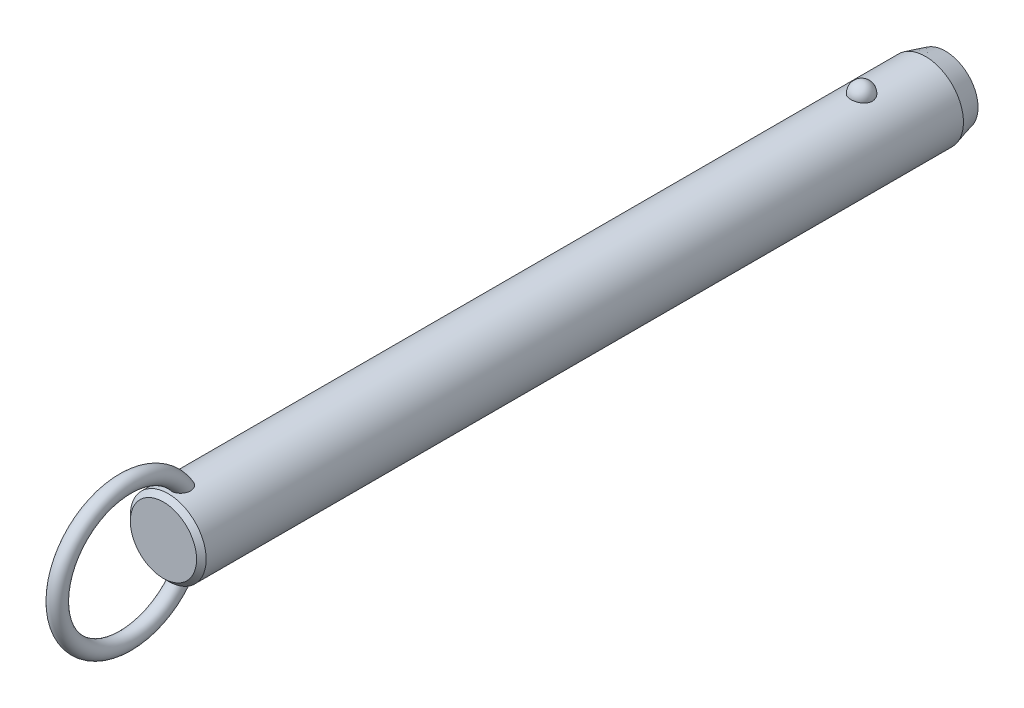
ISO-10303-21;
HEADER;
FILE_DESCRIPTION(('STEP AP214'),'2;1');
FILE_NAME('part.step','',(''),(''),'','','');
FILE_SCHEMA(('AUTOMOTIVE_DESIGN { 1 0 10303 214 1 1 1 1 }'));
ENDSEC;
DATA;
#1=APPLICATION_CONTEXT('core data for automotive mechanical design processes');
#2=APPLICATION_PROTOCOL_DEFINITION('international standard','automotive_design',2000,#1);
#3=PRODUCT_CONTEXT('',#1,'mechanical');
#4=PRODUCT('Part','Part','',(#3));
#5=PRODUCT_RELATED_PRODUCT_CATEGORY('part','',(#4));
#6=PRODUCT_DEFINITION_FORMATION('','',#4);
#7=PRODUCT_DEFINITION_CONTEXT('part definition',#1,'design');
#8=PRODUCT_DEFINITION('design','',#6,#7);
#9=PRODUCT_DEFINITION_SHAPE('','',#8);
#10=(LENGTH_UNIT() NAMED_UNIT(*) SI_UNIT(.MILLI.,.METRE.));
#11=(NAMED_UNIT(*) PLANE_ANGLE_UNIT() SI_UNIT($,.RADIAN.));
#12=(NAMED_UNIT(*) SI_UNIT($,.STERADIAN.) SOLID_ANGLE_UNIT());
#13=UNCERTAINTY_MEASURE_WITH_UNIT(LENGTH_MEASURE(1.E-05),#10,'distance_accuracy_value','');
#14=(GEOMETRIC_REPRESENTATION_CONTEXT(3) GLOBAL_UNCERTAINTY_ASSIGNED_CONTEXT((#13)) GLOBAL_UNIT_ASSIGNED_CONTEXT((#10,
#11,#12)) REPRESENTATION_CONTEXT('',''));
#15=CARTESIAN_POINT('',(0.,0.,0.));
#16=DIRECTION('',(0.,0.,1.));
#17=DIRECTION('',(1.,0.,0.));
#18=AXIS2_PLACEMENT_3D('',#15,#16,#17);
#19=CARTESIAN_POINT('',(0.,0.,162.6));
#20=DIRECTION('',(0.,0.,-1.));
#21=DIRECTION('',(-1.,0.,0.));
#22=AXIS2_PLACEMENT_3D('',#19,#20,#21);
#23=CYLINDRICAL_SURFACE('',#22,9.5);
#24=CARTESIAN_POINT('',(2.67259918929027,9.11631578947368,-2.70000000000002));
#25=CARTESIAN_POINT('',(2.6725968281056,9.11631786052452,-2.54909854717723));
#26=CARTESIAN_POINT('',(2.66030567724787,9.11994722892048,-2.39816735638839));
#27=CARTESIAN_POINT('',(2.6114347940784,9.13405924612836,-2.10058568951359));
#28=CARTESIAN_POINT('',(2.57484658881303,9.14454428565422,-1.95393672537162));
#29=CARTESIAN_POINT('',(2.47830875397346,9.17117631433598,-1.66916069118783));
#30=CARTESIAN_POINT('',(2.41836936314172,9.18732082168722,-1.53102991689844));
#31=CARTESIAN_POINT('',(2.27661331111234,9.22346780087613,-1.26705393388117));
#32=CARTESIAN_POINT('',(2.19479699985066,9.24347021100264,-1.14120852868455));
#33=CARTESIAN_POINT('',(2.01085282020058,9.28522401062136,-0.904632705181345));
#34=CARTESIAN_POINT('',(1.90862396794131,9.30698376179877,-0.793982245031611));
#35=CARTESIAN_POINT('',(1.6867437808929,9.34973971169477,-0.59160721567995));
#36=CARTESIAN_POINT('',(1.56709244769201,9.37073591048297,-0.499882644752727));
#37=CARTESIAN_POINT('',(1.31393976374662,9.40956370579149,-0.338167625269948));
#38=CARTESIAN_POINT('',(1.18048026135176,9.42740444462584,-0.268113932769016));
#39=CARTESIAN_POINT('',(0.903154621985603,9.45799906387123,-0.151390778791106));
#40=CARTESIAN_POINT('',(0.759289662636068,9.47075351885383,-0.104718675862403));
#41=CARTESIAN_POINT('',(0.468074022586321,9.48956256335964,-0.0367633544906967));
#42=CARTESIAN_POINT('',(0.320836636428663,9.49573643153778,-0.0150275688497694));
#43=CARTESIAN_POINT('',(0.0246714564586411,9.50112183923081,0.00396199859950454));
#44=CARTESIAN_POINT('',(-0.124256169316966,9.50033406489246,0.00121819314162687));
#45=CARTESIAN_POINT('',(-0.417264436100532,9.4919475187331,-0.0284441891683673));
#46=CARTESIAN_POINT('',(-0.56138413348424,9.48444885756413,-0.0550074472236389));
#47=CARTESIAN_POINT('',(-0.842986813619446,9.46357853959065,-0.131064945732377));
#48=CARTESIAN_POINT('',(-0.980469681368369,9.450206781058,-0.180559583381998));
#49=CARTESIAN_POINT('',(-1.24585005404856,9.41890822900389,-0.301476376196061));
#50=CARTESIAN_POINT('',(-1.37368611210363,9.40095498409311,-0.373026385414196));
#51=CARTESIAN_POINT('',(-1.61552738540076,9.36242964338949,-0.536025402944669));
#52=CARTESIAN_POINT('',(-1.72953116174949,9.34185727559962,-0.627476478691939));
#53=CARTESIAN_POINT('',(-1.9429225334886,9.29984568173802,-0.829844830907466));
#54=CARTESIAN_POINT('',(-2.04198021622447,9.27839736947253,-0.941108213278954));
#55=CARTESIAN_POINT('',(-2.22026460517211,9.23735994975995,-1.17883414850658));
#56=CARTESIAN_POINT('',(-2.29948985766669,9.21777097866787,-1.30529781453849));
#57=CARTESIAN_POINT('',(-2.43697287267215,9.18238994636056,-1.57158566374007));
#58=CARTESIAN_POINT('',(-2.49497068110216,9.16664569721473,-1.71155057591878));
#59=CARTESIAN_POINT('',(-2.5872073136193,9.14104303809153,-1.99961197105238));
#60=CARTESIAN_POINT('',(-2.62144683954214,9.13118445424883,-2.1477082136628));
#61=CARTESIAN_POINT('',(-2.66521466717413,9.11850622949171,-2.44715424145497));
#62=CARTESIAN_POINT('',(-2.67484831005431,9.11565658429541,-2.59848735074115));
#63=CARTESIAN_POINT('',(-2.66946735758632,9.11723375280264,-2.90067317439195));
#64=CARTESIAN_POINT('',(-2.65445345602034,9.12166036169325,-3.05152590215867));
#65=CARTESIAN_POINT('',(-2.60029711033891,9.13724422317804,-3.34766110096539));
#66=CARTESIAN_POINT('',(-2.56127978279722,9.14836656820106,-3.49296833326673));
#67=CARTESIAN_POINT('',(-2.46018844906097,9.17606676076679,-3.77477535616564));
#68=CARTESIAN_POINT('',(-2.39811349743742,9.1926448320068,-3.91127478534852));
#69=CARTESIAN_POINT('',(-2.25202303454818,9.22952198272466,-4.17244273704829));
#70=CARTESIAN_POINT('',(-2.16788714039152,9.24984129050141,-4.29704106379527));
#71=CARTESIAN_POINT('',(-1.9799408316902,9.29188255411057,-4.53013066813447));
#72=CARTESIAN_POINT('',(-1.87612963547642,9.31360456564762,-4.63862130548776));
#73=CARTESIAN_POINT('',(-1.65105429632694,9.35612959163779,-4.83690299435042));
#74=CARTESIAN_POINT('',(-1.52972405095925,9.37692871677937,-4.9266199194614));
#75=CARTESIAN_POINT('',(-1.27318250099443,9.41518970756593,-5.08429106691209));
#76=CARTESIAN_POINT('',(-1.13797219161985,9.432651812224,-5.15224684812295));
#77=CARTESIAN_POINT('',(-0.859280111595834,9.46208255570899,-5.26371827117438));
#78=CARTESIAN_POINT('',(-0.715925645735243,9.47411833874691,-5.30753421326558));
#79=CARTESIAN_POINT('',(-0.423550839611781,9.4916822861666,-5.37076321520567));
#80=CARTESIAN_POINT('',(-0.2745312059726,9.49721125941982,-5.39017930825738));
#81=CARTESIAN_POINT('',(0.0218446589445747,9.50110860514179,-5.40390587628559));
#82=CARTESIAN_POINT('',(0.16917707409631,9.49961381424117,-5.39869609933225));
#83=CARTESIAN_POINT('',(0.460808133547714,9.48993906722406,-5.36441955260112));
#84=CARTESIAN_POINT('',(0.605106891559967,9.48175936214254,-5.33535367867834));
#85=CARTESIAN_POINT('',(0.886027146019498,9.4596376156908,-5.25435587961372));
#86=CARTESIAN_POINT('',(1.02267710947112,9.44571881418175,-5.20251612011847));
#87=CARTESIAN_POINT('',(1.28523827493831,9.41358993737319,-5.07741549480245));
#88=CARTESIAN_POINT('',(1.41114877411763,9.39537958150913,-5.00415322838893));
#89=CARTESIAN_POINT('',(1.65085227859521,9.3562644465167,-4.83684599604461));
#90=CARTESIAN_POINT('',(1.76442346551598,9.33532178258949,-4.74249218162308));
#91=CARTESIAN_POINT('',(1.97425672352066,9.29321198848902,-4.53620389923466));
#92=CARTESIAN_POINT('',(2.07051582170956,9.27204482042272,-4.42426641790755));
#93=CARTESIAN_POINT('',(2.24490086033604,9.23139221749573,-4.18363183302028));
#94=CARTESIAN_POINT('',(2.32267019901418,9.21194380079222,-4.05466990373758));
#95=CARTESIAN_POINT('',(2.45584092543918,9.1773419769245,-3.78517836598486));
#96=CARTESIAN_POINT('',(2.5112497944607,9.16218713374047,-3.644652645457));
#97=CARTESIAN_POINT('',(2.59380876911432,9.13913522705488,-3.37104301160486));
#98=CARTESIAN_POINT('',(2.62330266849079,9.13064624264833,-3.23871053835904));
#99=CARTESIAN_POINT('',(2.66269870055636,9.11923566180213,-2.97092664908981));
#100=CARTESIAN_POINT('',(2.67260130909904,9.11631393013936,-2.83547530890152));
#101=CARTESIAN_POINT('',(2.67259918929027,9.11631578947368,-2.70000000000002));
#102=B_SPLINE_CURVE_WITH_KNOTS('',3,(#24,#25,#26,#27,#28,#29,#30,#31,#32,#33,#34,#35,#36,#37,
#38,#39,#40,#41,#42,#43,#44,#45,#46,#47,#48,#49,#50,#51,#52,#53,#54,#55,#56,#57,#58,#59,#60,#61,
#62,#63,#64,#65,#66,#67,#68,#69,#70,#71,#72,#73,#74,#75,#76,#77,#78,#79,#80,#81,#82,#83,#84,#85,
#86,#87,#88,#89,#90,#91,#92,#93,#94,#95,#96,#97,#98,#99,#100,#101),.UNSPECIFIED.,.T.,.F.,(4,2,2,
2,2,2,2,2,2,2,2,2,2,2,2,2,2,2,2,2,2,2,2,2,2,2,2,2,2,2,2,2,2,2,2,2,2,2,4),(0.,0.452217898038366,
0.904593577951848,1.35677112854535,1.80894144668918,2.26340676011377,2.71787203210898,
3.17099820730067,3.62407318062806,4.0687883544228,4.51345969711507,4.95160616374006,
5.38976021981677,5.83050358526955,6.27129275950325,6.72071308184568,7.17016633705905,
7.62495278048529,8.07972578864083,8.53254856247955,8.98535859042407,9.43582813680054,
9.88631615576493,10.3393155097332,10.7923328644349,11.2471065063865,11.7018475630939,
12.150795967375,12.599688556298,13.0398725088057,13.4800399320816,13.9184421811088,
14.3568730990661,14.802202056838,15.2476074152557,15.7010097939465,16.1542603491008,
16.5602594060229,16.966248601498),.UNSPECIFIED.);
#103=CARTESIAN_POINT('',(2.67259918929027,9.11631578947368,-2.70000000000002));
#104=VERTEX_POINT('',#103);
#105=EDGE_CURVE('E41',#104,#104,#102,.T.);
#106=ORIENTED_EDGE('',*,*,#105,.T.);
#107=EDGE_LOOP('',(#106));
#108=FACE_BOUND('',#107,.T.);
#109=CARTESIAN_POINT('',(0.,0.,170.92));
#110=DIRECTION('',(0.,0.,1.));
#111=DIRECTION('',(1.,0.,0.));
#112=AXIS2_PLACEMENT_3D('',#109,#110,#111);
#113=CIRCLE('',#112,9.5);
#114=CARTESIAN_POINT('',(9.5,0.,170.92));
#115=VERTEX_POINT('',#114);
#116=EDGE_CURVE('E10',#115,#115,#113,.F.);
#117=ORIENTED_EDGE('',*,*,#116,.T.);
#118=EDGE_LOOP('',(#117));
#119=FACE_BOUND('',#118,.T.);
#120=CARTESIAN_POINT('',(-0.697062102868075,-9.47439269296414,165.267808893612));
#121=CARTESIAN_POINT('',(-0.799579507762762,-9.46685146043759,165.307482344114));
#122=CARTESIAN_POINT('',(-0.89857563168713,-9.45788043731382,165.3559309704));
#123=CARTESIAN_POINT('',(-1.08670047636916,-9.43811593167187,165.468868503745));
#124=CARTESIAN_POINT('',(-1.17583204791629,-9.42732297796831,165.533352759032));
#125=CARTESIAN_POINT('',(-1.34179806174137,-9.40513672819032,165.676209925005));
#126=CARTESIAN_POINT('',(-1.41865133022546,-9.39374438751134,165.754561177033));
#127=CARTESIAN_POINT('',(-1.5586004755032,-9.37154196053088,165.922752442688));
#128=CARTESIAN_POINT('',(-1.62169476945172,-9.3607319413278,166.01259377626));
#129=CARTESIAN_POINT('',(-1.73527695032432,-9.34035749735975,166.204500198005));
#130=CARTESIAN_POINT('',(-1.7852226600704,-9.33085270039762,166.306891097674));
#131=CARTESIAN_POINT('',(-1.86924997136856,-9.3143834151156,166.518148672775));
#132=CARTESIAN_POINT('',(-1.90332570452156,-9.30741986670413,166.627017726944));
#133=CARTESIAN_POINT('',(-1.95893603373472,-9.29588482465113,166.860473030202));
#134=CARTESIAN_POINT('',(-1.97872420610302,-9.29165182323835,166.985489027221));
#135=CARTESIAN_POINT('',(-2.00062129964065,-9.28695978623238,167.237080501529));
#136=CARTESIAN_POINT('',(-2.00272284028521,-9.28650232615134,167.363656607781));
#137=CARTESIAN_POINT('',(-1.98958876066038,-9.28932750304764,167.636815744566));
#138=CARTESIAN_POINT('',(-1.97143366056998,-9.2932400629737,167.783251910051));
#139=CARTESIAN_POINT('',(-1.91479925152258,-9.30507151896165,168.072062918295));
#140=CARTESIAN_POINT('',(-1.87629122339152,-9.31299607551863,168.214431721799));
#141=CARTESIAN_POINT('',(-1.7722568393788,-9.33340232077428,168.515172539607));
#142=CARTESIAN_POINT('',(-1.70334898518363,-9.34641636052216,168.672369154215));
#143=CARTESIAN_POINT('',(-1.58111062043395,-9.36759153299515,168.897517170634));
#144=CARTESIAN_POINT('',(-1.53721459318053,-9.3749261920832,168.970796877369));
#145=CARTESIAN_POINT('',(-1.44302631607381,-9.38988566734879,169.11307405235));
#146=CARTESIAN_POINT('',(-1.39273721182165,-9.39751033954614,169.182073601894));
#147=CARTESIAN_POINT('',(-1.26775962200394,-9.41530678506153,169.336983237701));
#148=CARTESIAN_POINT('',(-1.19052326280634,-9.42548108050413,169.420871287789));
#149=CARTESIAN_POINT('',(-1.0242024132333,-9.44499825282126,169.576008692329));
#150=CARTESIAN_POINT('',(-0.935139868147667,-9.45434261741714,169.647280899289));
#151=CARTESIAN_POINT('',(-0.766610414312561,-9.46930670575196,169.758695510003));
#152=CARTESIAN_POINT('',(-0.689439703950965,-9.47529223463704,169.802235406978));
#153=CARTESIAN_POINT('',(-0.52894200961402,-9.48560294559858,169.87631336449));
#154=CARTESIAN_POINT('',(-0.445620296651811,-9.48992953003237,169.906862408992));
#155=CARTESIAN_POINT('',(-0.273901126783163,-9.49644161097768,169.952579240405));
#156=CARTESIAN_POINT('',(-0.18546574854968,-9.49860811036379,169.96761059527));
#157=CARTESIAN_POINT('',(-0.00734541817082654,-9.5004135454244,169.980149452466));
#158=CARTESIAN_POINT('',(0.082338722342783,-9.50005405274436,169.977667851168));
#159=CARTESIAN_POINT('',(0.247679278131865,-9.49708301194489,169.956995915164));
#160=CARTESIAN_POINT('',(0.323620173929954,-9.49477609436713,169.940930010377));
#161=CARTESIAN_POINT('',(0.471981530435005,-9.48855917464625,169.897172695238));
#162=CARTESIAN_POINT('',(0.544400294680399,-9.48464840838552,169.869475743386));
#163=CARTESIAN_POINT('',(0.708947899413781,-9.47398336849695,169.79280266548));
#164=CARTESIAN_POINT('',(0.799149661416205,-9.46671310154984,169.739774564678));
#165=CARTESIAN_POINT('',(0.969783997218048,-9.45076225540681,169.619973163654));
#166=CARTESIAN_POINT('',(1.05019415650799,-9.44207854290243,169.553169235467));
#167=CARTESIAN_POINT('',(1.23092343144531,-9.42051459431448,169.380759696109));
#168=CARTESIAN_POINT('',(1.32652499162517,-9.40733378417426,169.27026193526));
#169=CARTESIAN_POINT('',(1.49893121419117,-9.38140745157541,169.035561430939));
#170=CARTESIAN_POINT('',(1.57571616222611,-9.36866239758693,168.911344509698));
#171=CARTESIAN_POINT('',(1.71285426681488,-9.34457644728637,168.649389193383));
#172=CARTESIAN_POINT('',(1.77266365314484,-9.33328726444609,168.51136233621));
#173=CARTESIAN_POINT('',(1.87239208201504,-9.31379209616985,168.228051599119));
#174=CARTESIAN_POINT('',(1.91230158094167,-9.30558759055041,168.082764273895));
#175=CARTESIAN_POINT('',(1.97604189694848,-9.29228394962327,167.762028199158));
#176=CARTESIAN_POINT('',(1.9958743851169,-9.28797202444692,167.585724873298));
#177=CARTESIAN_POINT('',(2.00295708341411,-9.28645519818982,167.232414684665));
#178=CARTESIAN_POINT('',(1.99025930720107,-9.28923895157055,167.055409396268));
#179=CARTESIAN_POINT('',(1.93735479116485,-9.30038134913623,166.756338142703));
#180=CARTESIAN_POINT('',(1.90576827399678,-9.30697680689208,166.632667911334));
#181=CARTESIAN_POINT('',(1.82287484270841,-9.32356855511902,166.392329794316));
#182=CARTESIAN_POINT('',(1.77158213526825,-9.33356239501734,166.275656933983));
#183=CARTESIAN_POINT('',(1.64885744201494,-9.35602275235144,166.052706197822));
#184=CARTESIAN_POINT('',(1.57730995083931,-9.36850332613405,165.946492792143));
#185=CARTESIAN_POINT('',(1.41543264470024,-9.39431873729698,165.749553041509));
#186=CARTESIAN_POINT('',(1.32510883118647,-9.40765330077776,165.658821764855));
#187=CARTESIAN_POINT('',(1.13846223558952,-9.43195720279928,165.505033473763));
#188=CARTESIAN_POINT('',(1.04369890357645,-9.44302894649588,165.440094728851));
#189=CARTESIAN_POINT('',(0.843965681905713,-9.46296805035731,165.328038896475));
#190=CARTESIAN_POINT('',(0.739000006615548,-9.47183631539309,165.280914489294));
#191=CARTESIAN_POINT('',(0.528175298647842,-9.48586140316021,165.208117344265));
#192=CARTESIAN_POINT('',(0.422686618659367,-9.49119633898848,165.18140249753));
#193=CARTESIAN_POINT('',(0.208590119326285,-9.49831365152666,165.146013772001));
#194=CARTESIAN_POINT('',(0.0999817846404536,-9.500095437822,165.137342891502));
#195=CARTESIAN_POINT('',(-0.126104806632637,-9.49988861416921,165.138350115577));
#196=CARTESIAN_POINT('',(-0.24357872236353,-9.49757821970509,165.149594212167));
#197=CARTESIAN_POINT('',(-0.474390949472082,-9.48885165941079,165.193167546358));
#198=CARTESIAN_POINT('',(-0.587729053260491,-9.48243528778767,165.225497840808));
#199=CARTESIAN_POINT('',(-0.697062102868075,-9.47439269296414,165.267808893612));
#200=B_SPLINE_CURVE_WITH_KNOTS('',3,(#120,#121,#122,#123,#124,#125,#126,#127,#128,#129,#130,
#131,#132,#133,#134,#135,#136,#137,#138,#139,#140,#141,#142,#143,#144,#145,#146,#147,#148,#149,
#150,#151,#152,#153,#154,#155,#156,#157,#158,#159,#160,#161,#162,#163,#164,#165,#166,#167,#168,
#169,#170,#171,#172,#173,#174,#175,#176,#177,#178,#179,#180,#181,#182,#183,#184,#185,#186,#187,
#188,#189,#190,#191,#192,#193,#194,#195,#196,#197,#198,#199),.UNSPECIFIED.,.T.,.F.,(4,2,2,2,2,2,
2,2,2,2,2,2,2,2,2,2,2,2,2,2,2,2,2,2,2,2,2,2,2,2,2,2,2,2,2,2,2,2,2,4),(0.,0.330119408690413,
0.6601431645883,0.98965593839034,1.31920659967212,1.66074728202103,2.00241415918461,
2.38088696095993,2.75951768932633,3.20065679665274,3.64242004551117,4.15620996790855,
4.4131416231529,4.66994734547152,5.01228664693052,5.35399933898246,5.61943037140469,
5.88463652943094,6.15215502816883,6.41950709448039,6.65144391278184,6.88349136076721,
7.19641200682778,7.51003602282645,7.94779711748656,8.3860149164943,8.83699707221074,
9.28819530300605,9.81778662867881,10.34653170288,10.7284172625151,11.1100280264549,
11.4938603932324,11.8775702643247,12.2220189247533,12.5663259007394,12.8915939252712,
13.2169159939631,13.5689650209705,13.9210316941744),.UNSPECIFIED.);
#201=CARTESIAN_POINT('',(-0.697062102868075,-9.47439269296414,165.267808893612));
#202=VERTEX_POINT('',#201);
#203=EDGE_CURVE('E60',#202,#202,#200,.T.);
#204=ORIENTED_EDGE('',*,*,#203,.T.);
#205=EDGE_LOOP('',(#204));
#206=FACE_BOUND('',#205,.T.);
#207=CARTESIAN_POINT('',(-0.697062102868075,9.47439269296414,165.267808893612));
#208=CARTESIAN_POINT('',(-0.597792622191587,9.48169483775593,165.22939564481));
#209=CARTESIAN_POINT('',(-0.495106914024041,9.48766580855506,165.199168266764));
#210=CARTESIAN_POINT('',(-0.285876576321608,9.49627648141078,165.156032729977));
#211=CARTESIAN_POINT('',(-0.179324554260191,9.49890941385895,165.143159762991));
#212=CARTESIAN_POINT('',(0.0344157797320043,9.50053798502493,165.135166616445));
#213=CARTESIAN_POINT('',(0.14160360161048,9.49953613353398,165.140034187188));
#214=CARTESIAN_POINT('',(0.353563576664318,9.49401038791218,165.167365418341));
#215=CARTESIAN_POINT('',(0.458336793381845,9.48948807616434,165.18982117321));
#216=CARTESIAN_POINT('',(0.662493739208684,9.4774236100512,165.251671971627));
#217=CARTESIAN_POINT('',(0.761881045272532,9.46988348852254,165.291055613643));
#218=CARTESIAN_POINT('',(0.952608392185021,9.45260382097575,165.385634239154));
#219=CARTESIAN_POINT('',(1.04394806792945,9.44286417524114,165.440829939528));
#220=CARTESIAN_POINT('',(1.21712767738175,9.42211760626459,165.566066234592));
#221=CARTESIAN_POINT('',(1.29885671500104,9.41109835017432,165.636257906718));
#222=CARTESIAN_POINT('',(1.44978975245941,9.38903310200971,165.788980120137));
#223=CARTESIAN_POINT('',(1.51899278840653,9.37798710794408,165.871511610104));
#224=CARTESIAN_POINT('',(1.64602857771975,9.35654375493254,166.049776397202));
#225=CARTESIAN_POINT('',(1.70333052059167,9.34618688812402,166.145891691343));
#226=CARTESIAN_POINT('',(1.80259341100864,9.32755128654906,166.345897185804));
#227=CARTESIAN_POINT('',(1.84454942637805,9.31927322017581,166.449789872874));
#228=CARTESIAN_POINT('',(1.91637039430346,9.30478365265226,166.672213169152));
#229=CARTESIAN_POINT('',(1.944805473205,9.29882552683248,166.791219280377));
#230=CARTESIAN_POINT('',(1.98449865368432,9.29043398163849,167.032143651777));
#231=CARTESIAN_POINT('',(1.99574908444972,9.28800213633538,167.154063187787));
#232=CARTESIAN_POINT('',(2.00275141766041,9.28649645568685,167.416932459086));
#233=CARTESIAN_POINT('',(1.99588238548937,9.28799035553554,167.557952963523));
#234=CARTESIAN_POINT('',(1.96270559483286,9.29505517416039,167.837621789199));
#235=CARTESIAN_POINT('',(1.93637872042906,9.30063010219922,167.976267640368));
#236=CARTESIAN_POINT('',(1.85949176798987,9.31633564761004,168.272561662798));
#237=CARTESIAN_POINT('',(1.80549792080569,9.3270926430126,168.429290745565));
#238=CARTESIAN_POINT('',(1.67376869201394,9.3516306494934,168.732284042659));
#239=CARTESIAN_POINT('',(1.59603181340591,9.36541185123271,168.878547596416));
#240=CARTESIAN_POINT('',(1.4360277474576,9.39110706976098,169.125813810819));
#241=CARTESIAN_POINT('',(1.35831795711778,9.40278656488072,169.229791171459));
#242=CARTESIAN_POINT('',(1.18774483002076,9.42585025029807,169.424534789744));
#243=CARTESIAN_POINT('',(1.09490932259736,9.43723493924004,169.515324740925));
#244=CARTESIAN_POINT('',(0.921110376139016,9.45552616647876,169.65620334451));
#245=CARTESIAN_POINT('',(0.843738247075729,9.46281058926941,169.710656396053));
#246=CARTESIAN_POINT('',(0.681245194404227,9.47589120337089,169.806711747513));
#247=CARTESIAN_POINT('',(0.596135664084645,9.48168953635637,169.848332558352));
#248=CARTESIAN_POINT('',(0.433779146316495,9.49038144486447,169.910089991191));
#249=CARTESIAN_POINT('',(0.35745955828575,9.49359170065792,169.93260136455));
#250=CARTESIAN_POINT('',(0.202074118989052,9.49816761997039,169.964574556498));
#251=CARTESIAN_POINT('',(0.123010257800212,9.49953459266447,169.974045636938));
#252=CARTESIAN_POINT('',(-0.0357372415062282,9.50026497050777,169.979114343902));
#253=CARTESIAN_POINT('',(-0.115421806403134,9.49962433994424,169.974684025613));
#254=CARTESIAN_POINT('',(-0.272823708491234,9.49640854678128,169.952296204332));
#255=CARTESIAN_POINT('',(-0.350540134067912,9.4938325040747,169.934332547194));
#256=CARTESIAN_POINT('',(-0.500580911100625,9.48709462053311,169.886802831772));
#257=CARTESIAN_POINT('',(-0.572979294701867,9.48296359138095,169.857461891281));
#258=CARTESIAN_POINT('',(-0.71286452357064,9.47347609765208,169.789008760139));
#259=CARTESIAN_POINT('',(-0.780349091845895,9.46811906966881,169.749892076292));
#260=CARTESIAN_POINT('',(-0.946309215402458,9.45329720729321,169.639432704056));
#261=CARTESIAN_POINT('',(-1.04090230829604,9.44321512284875,169.562329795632));
#262=CARTESIAN_POINT('',(-1.21661929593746,9.42219227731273,169.39409718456));
#263=CARTESIAN_POINT('',(-1.29770519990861,9.41124921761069,169.302929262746));
#264=CARTESIAN_POINT('',(-1.47319646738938,9.38563439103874,169.076162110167));
#265=CARTESIAN_POINT('',(-1.5620887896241,9.37102009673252,168.936289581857));
#266=CARTESIAN_POINT('',(-1.71623987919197,9.34401559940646,168.643950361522));
#267=CARTESIAN_POINT('',(-1.7814786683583,9.33162728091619,168.491473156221));
#268=CARTESIAN_POINT('',(-1.88853837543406,9.31055541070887,168.175647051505));
#269=CARTESIAN_POINT('',(-1.92998995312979,9.30193076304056,168.012168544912));
#270=CARTESIAN_POINT('',(-1.98590726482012,9.29015757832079,167.680526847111));
#271=CARTESIAN_POINT('',(-2.0004070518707,9.2870021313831,167.512369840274));
#272=CARTESIAN_POINT('',(-1.99964701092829,9.28716218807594,167.205080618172));
#273=CARTESIAN_POINT('',(-1.98908145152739,9.28945704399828,167.065936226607));
#274=CARTESIAN_POINT('',(-1.94566294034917,9.29865169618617,166.791153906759));
#275=CARTESIAN_POINT('',(-1.91282062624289,9.30554929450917,166.655514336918));
#276=CARTESIAN_POINT('',(-1.84582133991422,9.31898248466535,166.457802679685));
#277=CARTESIAN_POINT('',(-1.82038084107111,9.32400364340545,166.392583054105));
#278=CARTESIAN_POINT('',(-1.7635051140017,9.33492884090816,166.264903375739));
#279=CARTESIAN_POINT('',(-1.73207305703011,9.34083241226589,166.202441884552));
#280=CARTESIAN_POINT('',(-1.66324243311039,9.35333332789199,166.08094078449));
#281=CARTESIAN_POINT('',(-1.625842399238,9.35993084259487,166.021902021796));
#282=CARTESIAN_POINT('',(-1.54527678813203,9.37356864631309,165.907987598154));
#283=CARTESIAN_POINT('',(-1.50211241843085,9.38060884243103,165.853111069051));
#284=CARTESIAN_POINT('',(-1.37681147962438,9.40004442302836,165.709961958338));
#285=CARTESIAN_POINT('',(-1.28916358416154,9.41261047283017,165.626429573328));
#286=CARTESIAN_POINT('',(-1.09996826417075,9.43658180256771,165.477236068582));
#287=CARTESIAN_POINT('',(-0.998461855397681,9.44799034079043,165.411523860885));
#288=CARTESIAN_POINT('',(-0.860188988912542,9.46103017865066,165.3394367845));
#289=CARTESIAN_POINT('',(-0.828141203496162,9.46389141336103,165.323851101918));
#290=CARTESIAN_POINT('',(-0.763210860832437,9.46934915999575,165.294473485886));
#291=CARTESIAN_POINT('',(-0.730328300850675,9.47194567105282,165.280681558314));
#292=CARTESIAN_POINT('',(-0.697062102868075,9.47439269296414,165.267808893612));
#293=B_SPLINE_CURVE_WITH_KNOTS('',3,(#207,#208,#209,#210,#211,#212,#213,#214,#215,#216,#217,
#218,#219,#220,#221,#222,#223,#224,#225,#226,#227,#228,#229,#230,#231,#232,#233,#234,#235,#236,
#237,#238,#239,#240,#241,#242,#243,#244,#245,#246,#247,#248,#249,#250,#251,#252,#253,#254,#255,
#256,#257,#258,#259,#260,#261,#262,#263,#264,#265,#266,#267,#268,#269,#270,#271,#272,#273,#274,
#275,#276,#277,#278,#279,#280,#281,#282,#283,#284,#285,#286,#287,#288,#289,#290,#291,#292),
.UNSPECIFIED.,.T.,.F.,(4,2,2,2,2,2,2,2,2,2,2,2,2,2,2,2,2,2,2,2,2,2,2,2,2,2,2,2,2,2,2,2,2,2,2,2,
2,2,2,2,2,2,4),(0.,0.319942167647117,0.640532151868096,0.960900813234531,1.28112555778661,
1.60113495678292,1.92115886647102,2.24457323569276,2.56801248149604,2.90371927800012,
3.23953387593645,3.60560313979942,3.97183576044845,4.39383693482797,4.81625324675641,
5.31257045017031,5.80891895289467,6.19868344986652,6.58773876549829,6.87145417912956,
7.15475838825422,7.3926375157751,7.63034760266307,7.86853584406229,8.10683246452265,
8.3406366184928,8.57454843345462,8.93983939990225,9.30614105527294,9.80266668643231,
10.2996107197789,10.8040753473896,11.3079021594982,11.7249776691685,12.1418541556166,
12.3521485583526,12.5623319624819,12.7725671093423,12.9827582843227,13.345827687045,
13.7078449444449,13.8150604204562,13.9222762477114),.UNSPECIFIED.);
#294=CARTESIAN_POINT('',(-0.697062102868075,9.47439269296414,165.267808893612));
#295=VERTEX_POINT('',#294);
#296=EDGE_CURVE('E68',#295,#295,#293,.T.);
#297=ORIENTED_EDGE('',*,*,#296,.T.);
#298=EDGE_LOOP('',(#297));
#299=FACE_BOUND('',#298,.T.);
#300=CARTESIAN_POINT('',(0.,0.,-18.6999999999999));
#301=DIRECTION('',(0.,0.,-1.));
#302=DIRECTION('',(-1.,0.,0.));
#303=AXIS2_PLACEMENT_3D('',#300,#301,#302);
#304=CIRCLE('',#303,9.5);
#305=CARTESIAN_POINT('',(-9.5,0.,-18.6999999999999));
#306=VERTEX_POINT('',#305);
#307=EDGE_CURVE('E57',#306,#306,#304,.F.);
#308=ORIENTED_EDGE('',*,*,#307,.T.);
#309=EDGE_LOOP('',(#308));
#310=FACE_BOUND('',#309,.T.);
#311=ADVANCED_FACE('F37',(#108,#119,#206,#299,#310),#23,.T.);
#312=CARTESIAN_POINT('',(0.,0.,-23.7));
#313=DIRECTION('',(0.,0.,-1.));
#314=DIRECTION('',(-1.,0.,0.));
#315=AXIS2_PLACEMENT_3D('',#312,#313,#314);
#316=PLANE('',#315);
#317=CARTESIAN_POINT('',(0.,0.,-23.7));
#318=DIRECTION('',(0.,0.,-1.));
#319=DIRECTION('',(-1.,0.,0.));
#320=AXIS2_PLACEMENT_3D('',#317,#318,#319);
#321=CIRCLE('',#320,8.16025403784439);
#322=CARTESIAN_POINT('',(-8.16025403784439,0.,-23.7));
#323=VERTEX_POINT('',#322);
#324=EDGE_CURVE('E67',#323,#323,#321,.T.);
#325=ORIENTED_EDGE('',*,*,#324,.T.);
#326=EDGE_LOOP('',(#325));
#327=FACE_BOUND('',#326,.T.);
#328=ADVANCED_FACE('F86',(#327),#316,.T.);
#329=CARTESIAN_POINT('',(0.,0.,-23.7));
#330=DIRECTION('',(0.,0.,1.));
#331=DIRECTION('',(1.,0.,0.));
#332=AXIS2_PLACEMENT_3D('',#329,#330,#331);
#333=CONICAL_SURFACE('',#332,8.16025403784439,0.261799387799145);
#334=ORIENTED_EDGE('',*,*,#307,.F.);
#335=EDGE_LOOP('',(#334));
#336=FACE_BOUND('',#335,.T.);
#337=ORIENTED_EDGE('',*,*,#324,.F.);
#338=EDGE_LOOP('',(#337));
#339=FACE_BOUND('',#338,.T.);
#340=ADVANCED_FACE('F84',(#336,#339),#333,.T.);
#341=CARTESIAN_POINT('',(0.,0.,172.12));
#342=DIRECTION('',(0.,0.,1.));
#343=DIRECTION('',(1.,0.,0.));
#344=AXIS2_PLACEMENT_3D('',#341,#342,#343);
#345=PLANE('',#344);
#346=CARTESIAN_POINT('',(0.,0.,172.12));
#347=DIRECTION('',(0.,0.,1.));
#348=DIRECTION('',(1.,0.,0.));
#349=AXIS2_PLACEMENT_3D('',#346,#347,#348);
#350=CIRCLE('',#349,8.3);
#351=CARTESIAN_POINT('',(8.3,0.,172.12));
#352=VERTEX_POINT('',#351);
#353=EDGE_CURVE('E50',#352,#352,#350,.T.);
#354=ORIENTED_EDGE('',*,*,#353,.T.);
#355=EDGE_LOOP('',(#354));
#356=FACE_BOUND('',#355,.T.);
#357=ADVANCED_FACE('F78',(#356),#345,.T.);
#358=CARTESIAN_POINT('',(0.,0.,181.65));
#359=DIRECTION('',(1.,0.,0.));
#360=DIRECTION('',(0.,0.,-1.));
#361=AXIS2_PLACEMENT_3D('',#358,#359,#360);
#362=TOROIDAL_SURFACE('',#361,17.05,2.);
#363=ORIENTED_EDGE('',*,*,#296,.F.);
#364=EDGE_LOOP('',(#363));
#365=FACE_BOUND('',#364,.T.);
#366=ORIENTED_EDGE('',*,*,#203,.F.);
#367=EDGE_LOOP('',(#366));
#368=FACE_BOUND('',#367,.T.);
#369=ADVANCED_FACE('F74',(#365,#368),#362,.T.);
#370=CARTESIAN_POINT('',(0.,0.,172.12));
#371=DIRECTION('',(0.,0.,-1.));
#372=DIRECTION('',(-1.,0.,0.));
#373=AXIS2_PLACEMENT_3D('',#370,#371,#372);
#374=CONICAL_SURFACE('',#373,8.3,0.785398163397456);
#375=ORIENTED_EDGE('',*,*,#116,.F.);
#376=EDGE_LOOP('',(#375));
#377=FACE_BOUND('',#376,.T.);
#378=ORIENTED_EDGE('',*,*,#353,.F.);
#379=EDGE_LOOP('',(#378));
#380=FACE_BOUND('',#379,.T.);
#381=ADVANCED_FACE('F39',(#377,#380),#374,.T.);
#382=CARTESIAN_POINT('',(0.,9.5,-2.70000000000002));
#383=DIRECTION('',(0.,1.,0.));
#384=DIRECTION('',(0.,0.,-1.));
#385=AXIS2_PLACEMENT_3D('',#382,#383,#384);
#386=SPHERICAL_SURFACE('',#385,2.7);
#387=ORIENTED_EDGE('',*,*,#105,.F.);
#388=EDGE_LOOP('',(#387));
#389=FACE_BOUND('',#388,.T.);
#390=ADVANCED_FACE('F80',(#389),#386,.T.);
#391=CLOSED_SHELL('',(#311,#328,#340,#357,#369,#381,#390));
#392=MANIFOLD_SOLID_BREP('B2',#391);
#393=ADVANCED_BREP_SHAPE_REPRESENTATION('',(#18,#392),#14);
#394=SHAPE_DEFINITION_REPRESENTATION(#9,#393);
ENDSEC;
END-ISO-10303-21;
